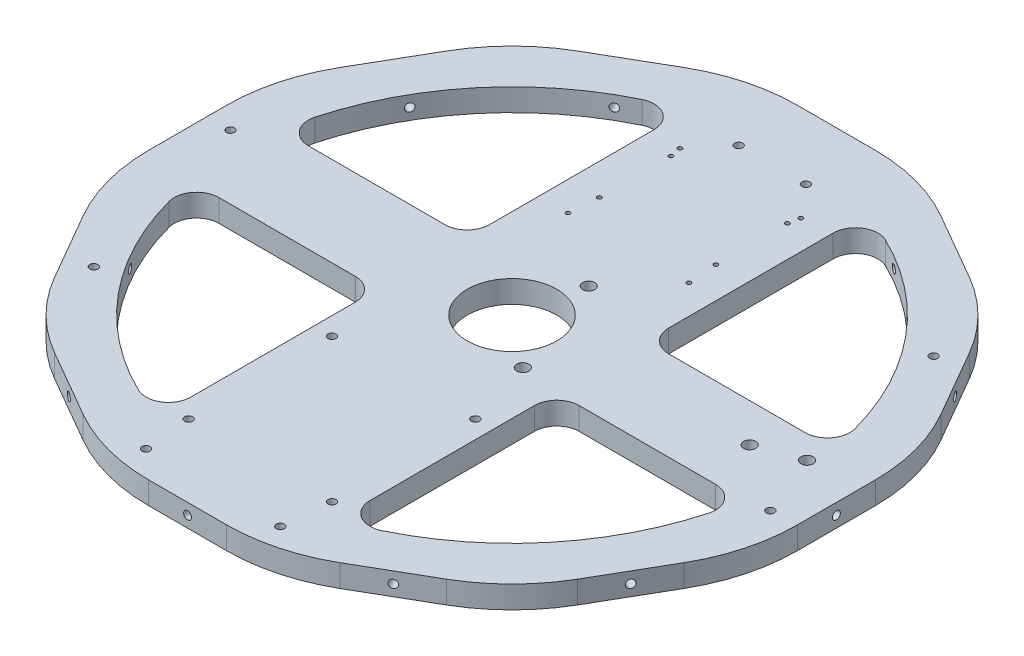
from build123d import *

# Parameters (mm, degrees)
SKETCH1_R             = 12.7
BOSS_EXTRUDE1_DEPTH   = 6.35
CUT_EXTRUDE2_DEPTH    = 131.262513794
MIRROR2_COPY_1_DEPTH  = 131.262513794
F_0_80_TAPPED_HOLE1_D = 1.19126
LPATTERN1_COUNT       = 2
LPATTERN1_PITCH       = 6.35
F_4_40_TAPPED_HOLE1_D = 2.2606
LPATTERN2_COUNT       = 2
LPATTERN2_PITCH       = 6.35
F_8_32_TAPPED_HOLE1_D = 3.4544
FILLET1_R             = 50.8
CIRPATTERN1_COUNT     = 12
F_4_40_TAPPED_HOLE3_D = 2.2606
F_4_40_TAPPED_HOLE5_D = 2.2606


with BuildPart() as part:
    # Sketch1 → Boss-Extrude1 (new body)
    with BuildSketch(Plane(origin=(0, 0, 0), x_dir=(1, 0, 0), z_dir=(0, 1, 0))):
        Polygon((67.348674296, 67.348674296), (24.651325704, 92), (-24.651325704, 92), (-67.348674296, 67.348674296), (-92, 24.651325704), (-92, -24.651325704), (-67.348674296, -67.348674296), (-24.651325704, -92), (24.651325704, -92), (67.348674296, -67.348674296), (92, -24.651325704), (92, 24.651325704), align=None)
        with Locations(Location((0, 0, 0), (0, 0, 270))):
            Circle(SKETCH1_R, mode=Mode.SUBTRACT)
    extrude(amount=BOSS_EXTRUDE1_DEPTH)

    # Sketch3 → Cut-Extrude2 (cut, through all)
    with BuildSketch(Plane(origin=(0, 6.35, 0), x_dir=(1, 0, 0), z_dir=(0, 1, 0))):
        with BuildLine():
            Line((70.418747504, -12.7), (31.75, -12.7))
            ThreePointArc((31.75, -12.7), (27.259871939, -14.559871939), (25.4, -19.05))
            Line((25.4, -19.05), (25.4, -65.678306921))
            ThreePointArc((25.4, -65.678306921), (28.375614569, -71.057528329), (34.513708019, -71.395335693))
            ThreePointArc((34.513708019, -71.395335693), (61.040924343, -50.621097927), (76.548412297, -20.708224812))
            ThreePointArc((76.548412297, -20.708224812), (75.46117884, -15.190416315), (70.418747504, -12.7))
        make_face()
    cut_extrude2 = extrude(amount=-CUT_EXTRUDE2_DEPTH, mode=Mode.SUBTRACT)

    # Mirror1: Cut-Extrude2 across plane
    add(cut_extrude2.mirror(Plane(origin=(0, 0, 0), x_dir=(0, 0, 1), z_dir=(1, 0, 0))), mode=Mode.SUBTRACT)

    # Mirror2: Cut-Extrude2 across plane
    add(cut_extrude2.mirror(Plane.XY), mode=Mode.SUBTRACT)

    # Mirror2 copy 1 sketch → Mirror2 copy 1 (cut, through all)
    with BuildSketch(Plane(origin=(0, 6.35, 0), x_dir=(-1, 0, 0), z_dir=(0, 1, 0))):
        with BuildLine():
            Line((70.418747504, -12.7), (31.75, -12.7))
            ThreePointArc((31.75, -12.7), (27.259871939, -14.559871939), (25.4, -19.05))
            Line((25.4, -19.05), (25.4, -65.678306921))
            ThreePointArc((25.4, -65.678306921), (28.375614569, -71.057528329), (34.513708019, -71.395335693))
            ThreePointArc((34.513708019, -71.395335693), (61.040924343, -50.621097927), (76.548412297, -20.708224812))
            ThreePointArc((76.548412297, -20.708224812), (75.46117884, -15.190416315), (70.418747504, -12.7))
        make_face()
    extrude(amount=-MIRROR2_COPY_1_DEPTH, mode=Mode.SUBTRACT)

    # 0-80 Tapped Hole1 (through all)
    with Locations(Plane(origin=(0, 6.35, 0), x_dir=(1, 0, 0), z_dir=(0, 1, 0))):
        with Locations((-17.145, 33.02), (17.145, 64.77), (-17.145, 64.77), (17.145, 33.02), (-16.51, 41.275), (-16.51, 61.595), (16.51, 61.595), (16.51, 41.275)):
            f_0_80_tapped_hole1 = Hole(F_0_80_TAPPED_HOLE1_D / 2)

    # LPattern1: 0-80 Tapped Hole1 ×2
    with Locations(*[(0, i * LPATTERN1_PITCH, 0) for i in range(1, LPATTERN1_COUNT)]):
        add(f_0_80_tapped_hole1, mode=Mode.SUBTRACT)

    # 4-40 Tapped Hole1 (through all)
    with Locations(Plane(origin=(0, 6.35, 0), x_dir=(1, 0, 0), z_dir=(0, 1, 0))):
        with Locations((-20.32, -30.734), (20.32, -30.734), (-20.32, -71.374), (20.32, -71.374)):
            f_4_40_tapped_hole1 = Hole(F_4_40_TAPPED_HOLE1_D / 2)

    # LPattern2: 4-40 Tapped Hole1 ×2
    with Locations(*[(0, i * LPATTERN2_PITCH, 0) for i in range(1, LPATTERN2_COUNT)]):
        add(f_4_40_tapped_hole1, mode=Mode.SUBTRACT)

    # 8-32 Tapped Hole1 (through all)
    with Locations(Plane(origin=(0, 6.35, 0), x_dir=(1, 0, 0), z_dir=(0, 1, 0))):
        with Locations((65.582523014, 1.820322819), (77.516619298, 6.16397864), (3.757051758, 17.990975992), (14.442445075, -11.366900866)):
            Hole(F_8_32_TAPPED_HOLE1_D / 2)

    # Fillet1
    fillet1_edges = [part.edges().sort_by_distance(p)[0] for p in [
        (92, 3.175, -24.651325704),
        (92, 3.175, 24.651325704),
        (67.348674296, 3.175, 67.348674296),
        (24.651325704, 3.175, 92),
        (-24.651325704, 3.175, 92),
        (-67.348674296, 3.175, 67.348674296),
        (-92, 3.175, 24.651325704),
        (-92, 3.175, -24.651325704),
        (-67.348674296, 3.175, -67.348674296),
        (-24.651325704, 3.175, -92),
        (24.651325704, 3.175, -92),
        (67.348674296, 3.175, -67.348674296),
    ]]
    fillet(fillet1_edges, radius=FILLET1_R)

    # Sketch12 → 4-40 Tapped Hole2 (revolve, cut)
    with BuildSketch(Plane(origin=(0, 3.175, 92), x_dir=(0, -1, 0), z_dir=(1, 0, 0))):
        Polygon((0, 0), (0, 13.379152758), (1.1303, 12.7), (1.1303, 0), align=None)
    f_4_40_tapped_hole2 = revolve(axis=Axis((0, 3.175, 98.35), (0, 0, -1)), mode=Mode.SUBTRACT)

    # CirPattern1: 4-40 Tapped Hole2 ×12 about axis
    cirpattern1_axis = Axis((0, 6.6675, 0), (0, -1, 0))
    for i in range(1, CIRPATTERN1_COUNT):
        add(f_4_40_tapped_hole2.rotate(cirpattern1_axis, i * 360 / CIRPATTERN1_COUNT), mode=Mode.SUBTRACT)

    # 4-40 Tapped Hole3 (through all)
    with Locations(Plane(origin=(0, 6.35, 0), x_dir=(1, 0, 0), z_dir=(0, 1, 0))):
        with Locations((-85.355975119, 5.49141824), (-71.174733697, -47.433695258)):
            Hole(F_4_40_TAPPED_HOLE3_D / 2)

    # 4-40 Tapped Hole5 (through all)
    with Locations(Plane(origin=(0, 6.35, 0), x_dir=(1, 0, 0), z_dir=(0, 1, 0))):
        with Locations((-19.05, -84.753447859), (19.05, -84.753447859), (84.666814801, -11.398465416), (69.878109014, 49.707017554), (-9.525, 73.809948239), (9.525, 73.809948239)):
            Hole(F_4_40_TAPPED_HOLE5_D / 2)


solid = part.part
